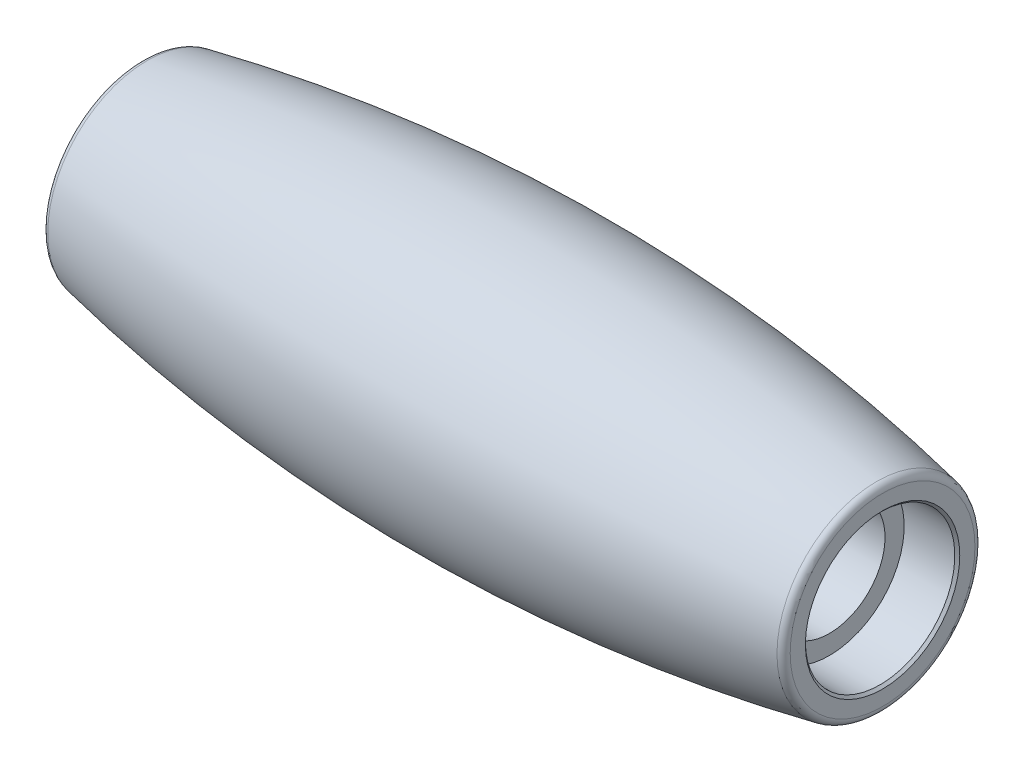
ISO-10303-21;
HEADER;
FILE_DESCRIPTION(('STEP AP214'),'2;1');
FILE_NAME('part.step','',(''),(''),'','','');
FILE_SCHEMA(('AUTOMOTIVE_DESIGN { 1 0 10303 214 1 1 1 1 }'));
ENDSEC;
DATA;
#1=APPLICATION_CONTEXT('core data for automotive mechanical design processes');
#2=APPLICATION_PROTOCOL_DEFINITION('international standard','automotive_design',2000,#1);
#3=PRODUCT_CONTEXT('',#1,'mechanical');
#4=PRODUCT('Part','Part','',(#3));
#5=PRODUCT_RELATED_PRODUCT_CATEGORY('part','',(#4));
#6=PRODUCT_DEFINITION_FORMATION('','',#4);
#7=PRODUCT_DEFINITION_CONTEXT('part definition',#1,'design');
#8=PRODUCT_DEFINITION('design','',#6,#7);
#9=PRODUCT_DEFINITION_SHAPE('','',#8);
#10=(LENGTH_UNIT() NAMED_UNIT(*) SI_UNIT(.MILLI.,.METRE.));
#11=(NAMED_UNIT(*) PLANE_ANGLE_UNIT() SI_UNIT($,.RADIAN.));
#12=(NAMED_UNIT(*) SI_UNIT($,.STERADIAN.) SOLID_ANGLE_UNIT());
#13=UNCERTAINTY_MEASURE_WITH_UNIT(LENGTH_MEASURE(1.E-05),#10,'distance_accuracy_value','');
#14=(GEOMETRIC_REPRESENTATION_CONTEXT(3) GLOBAL_UNCERTAINTY_ASSIGNED_CONTEXT((#13)) GLOBAL_UNIT_ASSIGNED_CONTEXT((#10,
#11,#12)) REPRESENTATION_CONTEXT('',''));
#15=CARTESIAN_POINT('',(0.,0.,0.));
#16=DIRECTION('',(0.,0.,1.));
#17=DIRECTION('',(1.,0.,0.));
#18=AXIS2_PLACEMENT_3D('',#15,#16,#17);
#19=CARTESIAN_POINT('',(-30.,9.375,0.));
#20=DIRECTION('',(-1.,0.,0.));
#21=DIRECTION('',(0.,0.,-1.));
#22=AXIS2_PLACEMENT_3D('',#19,#20,#21);
#23=PLANE('',#22);
#24=CARTESIAN_POINT('',(-30.,0.,0.));
#25=DIRECTION('',(1.,0.,0.));
#26=DIRECTION('',(0.,0.,-1.));
#27=AXIS2_PLACEMENT_3D('',#24,#25,#26);
#28=CIRCLE('',#27,6.24999999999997);
#29=CARTESIAN_POINT('',(-30.,0.,-6.24999999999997));
#30=VERTEX_POINT('',#29);
#31=EDGE_CURVE('E54',#30,#30,#28,.F.);
#32=ORIENTED_EDGE('',*,*,#31,.F.);
#33=EDGE_LOOP('',(#32));
#34=FACE_BOUND('',#33,.T.);
#35=CARTESIAN_POINT('',(-30.,0.,0.));
#36=DIRECTION('',(1.,0.,0.));
#37=DIRECTION('',(0.,0.,-1.));
#38=AXIS2_PLACEMENT_3D('',#35,#36,#37);
#39=CIRCLE('',#38,7.47866738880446);
#40=CARTESIAN_POINT('',(-30.,0.,-7.47866738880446));
#41=VERTEX_POINT('',#40);
#42=EDGE_CURVE('E86',#41,#41,#39,.T.);
#43=ORIENTED_EDGE('',*,*,#42,.F.);
#44=EDGE_LOOP('',(#43));
#45=FACE_BOUND('',#44,.T.);
#46=ADVANCED_FACE('F50',(#34,#45),#23,.T.);
#47=CARTESIAN_POINT('',(30.,9.375,0.));
#48=DIRECTION('',(-1.,0.,0.));
#49=DIRECTION('',(0.,0.,-1.));
#50=AXIS2_PLACEMENT_3D('',#47,#48,#49);
#51=PLANE('',#50);
#52=CARTESIAN_POINT('',(30.,0.,0.));
#53=DIRECTION('',(1.,0.,0.));
#54=DIRECTION('',(0.,0.,-1.));
#55=AXIS2_PLACEMENT_3D('',#52,#53,#54);
#56=CIRCLE('',#55,6.25000000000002);
#57=CARTESIAN_POINT('',(30.,0.,-6.25000000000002));
#58=VERTEX_POINT('',#57);
#59=EDGE_CURVE('E95',#58,#58,#56,.T.);
#60=ORIENTED_EDGE('',*,*,#59,.F.);
#61=EDGE_LOOP('',(#60));
#62=FACE_BOUND('',#61,.T.);
#63=CARTESIAN_POINT('',(30.,0.,0.));
#64=DIRECTION('',(1.,0.,0.));
#65=DIRECTION('',(0.,0.,-1.));
#66=AXIS2_PLACEMENT_3D('',#63,#64,#65);
#67=CIRCLE('',#66,7.47866738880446);
#68=CARTESIAN_POINT('',(30.,0.,-7.47866738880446));
#69=VERTEX_POINT('',#68);
#70=EDGE_CURVE('E81',#69,#69,#67,.F.);
#71=ORIENTED_EDGE('',*,*,#70,.F.);
#72=EDGE_LOOP('',(#71));
#73=FACE_BOUND('',#72,.T.);
#74=ADVANCED_FACE('F99',(#62,#73),#51,.F.);
#75=CARTESIAN_POINT('',(26.25,0.,0.));
#76=DIRECTION('',(-1.,0.,0.));
#77=DIRECTION('',(0.,0.,-1.));
#78=AXIS2_PLACEMENT_3D('',#75,#76,#77);
#79=CYLINDRICAL_SURFACE('',#78,4.5);
#80=CARTESIAN_POINT('',(-25.7,0.,0.));
#81=DIRECTION('',(1.,0.,0.));
#82=DIRECTION('',(0.,0.,-1.));
#83=AXIS2_PLACEMENT_3D('',#80,#81,#82);
#84=CIRCLE('',#83,4.5);
#85=CARTESIAN_POINT('',(-25.7,0.,4.5));
#86=VERTEX_POINT('',#85);
#87=EDGE_CURVE('E71',#86,#86,#84,.F.);
#88=ORIENTED_EDGE('',*,*,#87,.T.);
#89=DIRECTION('',(-1.,0.,0.));
#90=VECTOR('',#89,1.);
#91=CARTESIAN_POINT('',(26.25,0.,4.5));
#92=LINE('',#91,#90);
#93=CARTESIAN_POINT('',(25.7,0.,4.5));
#94=VERTEX_POINT('',#93);
#95=EDGE_CURVE('E65',#94,#86,#92,.T.);
#96=ORIENTED_EDGE('',*,*,#95,.F.);
#97=CARTESIAN_POINT('',(25.7,0.,0.));
#98=DIRECTION('',(-1.,0.,0.));
#99=DIRECTION('',(0.,0.,1.));
#100=AXIS2_PLACEMENT_3D('',#97,#98,#99);
#101=CIRCLE('',#100,4.5);
#102=EDGE_CURVE('E64',#94,#94,#101,.F.);
#103=ORIENTED_EDGE('',*,*,#102,.T.);
#104=ORIENTED_EDGE('',*,*,#95,.T.);
#105=EDGE_LOOP('',(#88,#96,#103,#104));
#106=FACE_BOUND('',#105,.T.);
#107=ADVANCED_FACE('F62',(#106),#79,.F.);
#108=CARTESIAN_POINT('',(25.7,0.,0.));
#109=DIRECTION('',(1.,0.,0.));
#110=DIRECTION('',(0.,0.,1.));
#111=AXIS2_PLACEMENT_3D('',#108,#109,#110);
#112=PLANE('',#111);
#113=CARTESIAN_POINT('',(25.7,0.,0.));
#114=DIRECTION('',(-1.,0.,0.));
#115=DIRECTION('',(0.,0.,1.));
#116=AXIS2_PLACEMENT_3D('',#113,#114,#115);
#117=CIRCLE('',#116,6.05);
#118=CARTESIAN_POINT('',(25.7,0.,6.05));
#119=VERTEX_POINT('',#118);
#120=EDGE_CURVE('E70',#119,#119,#117,.T.);
#121=ORIENTED_EDGE('',*,*,#120,.F.);
#122=EDGE_LOOP('',(#121));
#123=FACE_BOUND('',#122,.T.);
#124=ORIENTED_EDGE('',*,*,#102,.F.);
#125=EDGE_LOOP('',(#124));
#126=FACE_BOUND('',#125,.T.);
#127=ADVANCED_FACE('F124',(#123,#126),#112,.T.);
#128=CARTESIAN_POINT('',(25.7,0.,0.));
#129=DIRECTION('',(1.,0.,0.));
#130=DIRECTION('',(0.,0.,1.));
#131=AXIS2_PLACEMENT_3D('',#128,#129,#130);
#132=CYLINDRICAL_SURFACE('',#131,6.05);
#133=CARTESIAN_POINT('',(29.8,0.,0.));
#134=DIRECTION('',(1.,0.,0.));
#135=DIRECTION('',(0.,0.,-1.));
#136=AXIS2_PLACEMENT_3D('',#133,#134,#135);
#137=CIRCLE('',#136,6.05);
#138=CARTESIAN_POINT('',(29.8,0.,6.05));
#139=VERTEX_POINT('',#138);
#140=EDGE_CURVE('E87',#139,#139,#137,.F.);
#141=CARTESIAN_POINT('',(29.8,0.,6.05));
#142=CARTESIAN_POINT('',(29.7572916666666,0.,6.05));
#143=CARTESIAN_POINT('',(29.7145833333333,0.,6.05));
#144=CARTESIAN_POINT('',(29.6291666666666,0.,6.05));
#145=CARTESIAN_POINT('',(29.5864583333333,0.,6.05));
#146=CARTESIAN_POINT('',(29.5010416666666,0.,6.05));
#147=CARTESIAN_POINT('',(29.4583333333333,0.,6.05));
#148=CARTESIAN_POINT('',(29.3729166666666,0.,6.05));
#149=CARTESIAN_POINT('',(29.3302083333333,0.,6.05));
#150=CARTESIAN_POINT('',(29.2447916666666,0.,6.05));
#151=CARTESIAN_POINT('',(29.2020833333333,0.,6.05));
#152=CARTESIAN_POINT('',(29.1166666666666,0.,6.05));
#153=CARTESIAN_POINT('',(29.0739583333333,0.,6.05));
#154=CARTESIAN_POINT('',(28.9885416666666,0.,6.05));
#155=CARTESIAN_POINT('',(28.9458333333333,0.,6.05));
#156=CARTESIAN_POINT('',(28.8604166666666,0.,6.05));
#157=CARTESIAN_POINT('',(28.8177083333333,0.,6.05));
#158=CARTESIAN_POINT('',(28.7322916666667,0.,6.05));
#159=CARTESIAN_POINT('',(28.6895833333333,0.,6.05));
#160=CARTESIAN_POINT('',(28.6041666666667,0.,6.05));
#161=CARTESIAN_POINT('',(28.5614583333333,0.,6.05));
#162=CARTESIAN_POINT('',(28.4760416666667,0.,6.05));
#163=CARTESIAN_POINT('',(28.4333333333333,0.,6.05));
#164=CARTESIAN_POINT('',(28.3479166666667,0.,6.05));
#165=CARTESIAN_POINT('',(28.3052083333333,0.,6.05));
#166=CARTESIAN_POINT('',(28.2197916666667,0.,6.05));
#167=CARTESIAN_POINT('',(28.1770833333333,0.,6.05));
#168=CARTESIAN_POINT('',(28.0916666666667,0.,6.05));
#169=CARTESIAN_POINT('',(28.0489583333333,0.,6.05));
#170=CARTESIAN_POINT('',(27.9635416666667,0.,6.05));
#171=CARTESIAN_POINT('',(27.9208333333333,0.,6.05));
#172=CARTESIAN_POINT('',(27.8354166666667,0.,6.05));
#173=CARTESIAN_POINT('',(27.7927083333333,0.,6.05));
#174=CARTESIAN_POINT('',(27.7072916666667,0.,6.05));
#175=CARTESIAN_POINT('',(27.6645833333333,0.,6.05));
#176=CARTESIAN_POINT('',(27.5791666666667,0.,6.05));
#177=CARTESIAN_POINT('',(27.5364583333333,0.,6.05));
#178=CARTESIAN_POINT('',(27.4510416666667,0.,6.05));
#179=CARTESIAN_POINT('',(27.4083333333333,0.,6.05));
#180=CARTESIAN_POINT('',(27.3229166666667,0.,6.05));
#181=CARTESIAN_POINT('',(27.2802083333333,0.,6.05));
#182=CARTESIAN_POINT('',(27.1947916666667,0.,6.05));
#183=CARTESIAN_POINT('',(27.1520833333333,0.,6.05));
#184=CARTESIAN_POINT('',(27.0666666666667,0.,6.05));
#185=CARTESIAN_POINT('',(27.0239583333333,0.,6.05));
#186=CARTESIAN_POINT('',(26.9385416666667,0.,6.05));
#187=CARTESIAN_POINT('',(26.8958333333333,0.,6.05));
#188=CARTESIAN_POINT('',(26.8104166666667,0.,6.05));
#189=CARTESIAN_POINT('',(26.7677083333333,0.,6.05));
#190=CARTESIAN_POINT('',(26.6822916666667,0.,6.05));
#191=CARTESIAN_POINT('',(26.6395833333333,0.,6.05));
#192=CARTESIAN_POINT('',(26.5541666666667,0.,6.05));
#193=CARTESIAN_POINT('',(26.5114583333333,0.,6.05));
#194=CARTESIAN_POINT('',(26.4260416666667,0.,6.05));
#195=CARTESIAN_POINT('',(26.3833333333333,0.,6.05));
#196=CARTESIAN_POINT('',(26.2979166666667,0.,6.05));
#197=CARTESIAN_POINT('',(26.2552083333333,0.,6.05));
#198=CARTESIAN_POINT('',(26.1697916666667,0.,6.05));
#199=CARTESIAN_POINT('',(26.1270833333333,0.,6.05));
#200=CARTESIAN_POINT('',(26.0416666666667,0.,6.05));
#201=CARTESIAN_POINT('',(25.9989583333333,0.,6.05));
#202=CARTESIAN_POINT('',(25.9135416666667,0.,6.05));
#203=CARTESIAN_POINT('',(25.8708333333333,0.,6.05));
#204=CARTESIAN_POINT('',(25.7854166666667,0.,6.05));
#205=CARTESIAN_POINT('',(25.7427083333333,0.,6.05));
#206=CARTESIAN_POINT('',(25.7,0.,6.05));
#207=B_SPLINE_CURVE_WITH_KNOTS('',3,(#141,#142,#143,#144,#145,#146,#147,#148,#149,#150,#151,
#152,#153,#154,#155,#156,#157,#158,#159,#160,#161,#162,#163,#164,#165,#166,#167,#168,#169,#170,
#171,#172,#173,#174,#175,#176,#177,#178,#179,#180,#181,#182,#183,#184,#185,#186,#187,#188,#189,
#190,#191,#192,#193,#194,#195,#196,#197,#198,#199,#200,#201,#202,#203,#204,#205,#206),
.UNSPECIFIED.,.F.,.F.,(4,2,2,2,2,2,2,2,2,2,2,2,2,2,2,2,2,2,2,2,2,2,2,2,2,2,2,2,2,2,2,2,4),(0.,
0.128124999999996,0.256249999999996,0.384374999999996,0.512499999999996,0.640624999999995,
0.768749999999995,0.896874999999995,1.02499999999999,1.15312499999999,1.28124999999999,
1.40937499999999,1.53749999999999,1.66562499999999,1.79374999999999,1.92187499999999,
2.04999999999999,2.17812499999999,2.30624999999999,2.43437499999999,2.56249999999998,
2.69062499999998,2.81874999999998,2.94687499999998,3.07499999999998,3.20312499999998,
3.33124999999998,3.45937499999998,3.58749999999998,3.71562499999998,3.84374999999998,
3.97187499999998,4.09999999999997),.UNSPECIFIED.);
#208=EDGE_CURVE('BSEAM128',#139,#119,#207,.T.);
#209=ORIENTED_EDGE('',*,*,#140,.F.);
#210=ORIENTED_EDGE('',*,*,#120,.T.);
#211=ORIENTED_EDGE('',*,*,#208,.T.);
#212=ORIENTED_EDGE('',*,*,#208,.F.);
#213=EDGE_LOOP('',(#209,#211,#210,#212));
#214=FACE_BOUND('',#213,.T.);
#215=ADVANCED_FACE('F128',(#214),#132,.F.);
#216=CARTESIAN_POINT('',(-25.7,0.,0.));
#217=DIRECTION('',(-1.,0.,0.));
#218=DIRECTION('',(0.,0.,1.));
#219=AXIS2_PLACEMENT_3D('',#216,#217,#218);
#220=PLANE('',#219);
#221=CARTESIAN_POINT('',(-25.7,0.,0.));
#222=DIRECTION('',(-1.,0.,0.));
#223=DIRECTION('',(0.,0.,1.));
#224=AXIS2_PLACEMENT_3D('',#221,#222,#223);
#225=CIRCLE('',#224,6.05);
#226=CARTESIAN_POINT('',(-25.7,0.,-6.05));
#227=VERTEX_POINT('',#226);
#228=EDGE_CURVE('E77',#227,#227,#225,.T.);
#229=ORIENTED_EDGE('',*,*,#228,.T.);
#230=EDGE_LOOP('',(#229));
#231=FACE_BOUND('',#230,.T.);
#232=ORIENTED_EDGE('',*,*,#87,.F.);
#233=EDGE_LOOP('',(#232));
#234=FACE_BOUND('',#233,.T.);
#235=ADVANCED_FACE('F129',(#231,#234),#220,.T.);
#236=CARTESIAN_POINT('',(-25.7,0.,0.));
#237=DIRECTION('',(-1.,0.,0.));
#238=DIRECTION('',(0.,0.,-1.));
#239=AXIS2_PLACEMENT_3D('',#236,#237,#238);
#240=CYLINDRICAL_SURFACE('',#239,6.05);
#241=CARTESIAN_POINT('',(-29.8,0.,0.));
#242=DIRECTION('',(1.,0.,0.));
#243=DIRECTION('',(0.,0.,-1.));
#244=AXIS2_PLACEMENT_3D('',#241,#242,#243);
#245=CIRCLE('',#244,6.05);
#246=CARTESIAN_POINT('',(-29.8,0.,-6.05));
#247=VERTEX_POINT('',#246);
#248=EDGE_CURVE('E11',#247,#247,#245,.T.);
#249=CARTESIAN_POINT('',(-29.8,0.,-6.05));
#250=CARTESIAN_POINT('',(-29.7572916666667,0.,-6.05));
#251=CARTESIAN_POINT('',(-29.7145833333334,0.,-6.05));
#252=CARTESIAN_POINT('',(-29.6291666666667,0.,-6.05));
#253=CARTESIAN_POINT('',(-29.5864583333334,0.,-6.05));
#254=CARTESIAN_POINT('',(-29.5010416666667,0.,-6.05));
#255=CARTESIAN_POINT('',(-29.4583333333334,0.,-6.05));
#256=CARTESIAN_POINT('',(-29.3729166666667,0.,-6.05));
#257=CARTESIAN_POINT('',(-29.3302083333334,0.,-6.05));
#258=CARTESIAN_POINT('',(-29.2447916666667,0.,-6.05));
#259=CARTESIAN_POINT('',(-29.2020833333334,0.,-6.05));
#260=CARTESIAN_POINT('',(-29.1166666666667,0.,-6.05));
#261=CARTESIAN_POINT('',(-29.0739583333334,0.,-6.05));
#262=CARTESIAN_POINT('',(-28.9885416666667,0.,-6.05));
#263=CARTESIAN_POINT('',(-28.9458333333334,0.,-6.05));
#264=CARTESIAN_POINT('',(-28.8604166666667,0.,-6.05));
#265=CARTESIAN_POINT('',(-28.8177083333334,0.,-6.05));
#266=CARTESIAN_POINT('',(-28.7322916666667,0.,-6.05));
#267=CARTESIAN_POINT('',(-28.6895833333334,0.,-6.05));
#268=CARTESIAN_POINT('',(-28.6041666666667,0.,-6.05));
#269=CARTESIAN_POINT('',(-28.5614583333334,0.,-6.05));
#270=CARTESIAN_POINT('',(-28.4760416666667,0.,-6.05));
#271=CARTESIAN_POINT('',(-28.4333333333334,0.,-6.05));
#272=CARTESIAN_POINT('',(-28.3479166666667,0.,-6.05));
#273=CARTESIAN_POINT('',(-28.3052083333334,0.,-6.05));
#274=CARTESIAN_POINT('',(-28.2197916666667,0.,-6.05));
#275=CARTESIAN_POINT('',(-28.1770833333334,0.,-6.05));
#276=CARTESIAN_POINT('',(-28.0916666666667,0.,-6.05));
#277=CARTESIAN_POINT('',(-28.0489583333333,0.,-6.05));
#278=CARTESIAN_POINT('',(-27.9635416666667,0.,-6.05));
#279=CARTESIAN_POINT('',(-27.9208333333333,0.,-6.05));
#280=CARTESIAN_POINT('',(-27.8354166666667,0.,-6.05));
#281=CARTESIAN_POINT('',(-27.7927083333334,0.,-6.05));
#282=CARTESIAN_POINT('',(-27.7072916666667,0.,-6.05));
#283=CARTESIAN_POINT('',(-27.6645833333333,0.,-6.05));
#284=CARTESIAN_POINT('',(-27.5791666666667,0.,-6.05));
#285=CARTESIAN_POINT('',(-27.5364583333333,0.,-6.05));
#286=CARTESIAN_POINT('',(-27.4510416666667,0.,-6.05));
#287=CARTESIAN_POINT('',(-27.4083333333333,0.,-6.05));
#288=CARTESIAN_POINT('',(-27.3229166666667,0.,-6.05));
#289=CARTESIAN_POINT('',(-27.2802083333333,0.,-6.05));
#290=CARTESIAN_POINT('',(-27.1947916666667,0.,-6.05));
#291=CARTESIAN_POINT('',(-27.1520833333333,0.,-6.05));
#292=CARTESIAN_POINT('',(-27.0666666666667,0.,-6.05));
#293=CARTESIAN_POINT('',(-27.0239583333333,0.,-6.05));
#294=CARTESIAN_POINT('',(-26.9385416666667,0.,-6.05));
#295=CARTESIAN_POINT('',(-26.8958333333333,0.,-6.05));
#296=CARTESIAN_POINT('',(-26.8104166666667,0.,-6.05));
#297=CARTESIAN_POINT('',(-26.7677083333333,0.,-6.05));
#298=CARTESIAN_POINT('',(-26.6822916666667,0.,-6.05));
#299=CARTESIAN_POINT('',(-26.6395833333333,0.,-6.05));
#300=CARTESIAN_POINT('',(-26.5541666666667,0.,-6.05));
#301=CARTESIAN_POINT('',(-26.5114583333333,0.,-6.05));
#302=CARTESIAN_POINT('',(-26.4260416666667,0.,-6.05));
#303=CARTESIAN_POINT('',(-26.3833333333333,0.,-6.05));
#304=CARTESIAN_POINT('',(-26.2979166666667,0.,-6.05));
#305=CARTESIAN_POINT('',(-26.2552083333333,0.,-6.05));
#306=CARTESIAN_POINT('',(-26.1697916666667,0.,-6.05));
#307=CARTESIAN_POINT('',(-26.1270833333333,0.,-6.05));
#308=CARTESIAN_POINT('',(-26.0416666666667,0.,-6.05));
#309=CARTESIAN_POINT('',(-25.9989583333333,0.,-6.05));
#310=CARTESIAN_POINT('',(-25.9135416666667,0.,-6.05));
#311=CARTESIAN_POINT('',(-25.8708333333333,0.,-6.05));
#312=CARTESIAN_POINT('',(-25.7854166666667,0.,-6.05));
#313=CARTESIAN_POINT('',(-25.7427083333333,0.,-6.05));
#314=CARTESIAN_POINT('',(-25.7,0.,-6.05));
#315=B_SPLINE_CURVE_WITH_KNOTS('',3,(#249,#250,#251,#252,#253,#254,#255,#256,#257,#258,#259,
#260,#261,#262,#263,#264,#265,#266,#267,#268,#269,#270,#271,#272,#273,#274,#275,#276,#277,#278,
#279,#280,#281,#282,#283,#284,#285,#286,#287,#288,#289,#290,#291,#292,#293,#294,#295,#296,#297,
#298,#299,#300,#301,#302,#303,#304,#305,#306,#307,#308,#309,#310,#311,#312,#313,#314),
.UNSPECIFIED.,.F.,.F.,(4,2,2,2,2,2,2,2,2,2,2,2,2,2,2,2,2,2,2,2,2,2,2,2,2,2,2,2,2,2,2,2,4),(0.,
0.128125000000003,0.256250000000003,0.384375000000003,0.512500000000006,0.640625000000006,
0.768750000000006,0.896875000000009,1.02500000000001,1.15312500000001,1.28125000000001,
1.40937500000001,1.53750000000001,1.66562500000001,1.79375000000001,1.92187500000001,
2.05000000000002,2.17812500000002,2.30625000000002,2.43437500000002,2.56250000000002,
2.69062500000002,2.81875000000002,2.94687500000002,3.07500000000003,3.20312500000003,
3.33125000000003,3.45937500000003,3.58750000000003,3.71562500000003,3.84375000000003,
3.97187500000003,4.10000000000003),.UNSPECIFIED.);
#316=EDGE_CURVE('BSEAM132',#247,#227,#315,.T.);
#317=ORIENTED_EDGE('',*,*,#248,.F.);
#318=ORIENTED_EDGE('',*,*,#228,.F.);
#319=ORIENTED_EDGE('',*,*,#316,.T.);
#320=ORIENTED_EDGE('',*,*,#316,.F.);
#321=EDGE_LOOP('',(#317,#319,#318,#320));
#322=FACE_BOUND('',#321,.T.);
#323=ADVANCED_FACE('F132',(#322),#240,.F.);
#324=CARTESIAN_POINT('',(0.,0.,0.));
#325=DIRECTION('',(-1.,0.,0.));
#326=DIRECTION('',(0.,-1.,0.));
#327=AXIS2_PLACEMENT_3D('',#324,#325,#326);
#328=DEGENERATE_TOROIDAL_SURFACE('',#327,139.,150.,.F.);
#329=CARTESIAN_POINT('',(29.5180722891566,0.,0.));
#330=DIRECTION('',(1.,0.,0.));
#331=DIRECTION('',(0.,0.,-1.));
#332=AXIS2_PLACEMENT_3D('',#329,#330,#331);
#333=CIRCLE('',#332,8.06693512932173);
#334=CARTESIAN_POINT('',(29.5180722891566,0.,-8.06693512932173));
#335=VERTEX_POINT('',#334);
#336=EDGE_CURVE('E79',#335,#335,#333,.T.);
#337=ORIENTED_EDGE('',*,*,#336,.F.);
#338=EDGE_LOOP('',(#337));
#339=FACE_BOUND('',#338,.T.);
#340=CARTESIAN_POINT('',(-29.5180722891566,0.,0.));
#341=DIRECTION('',(-1.,0.,0.));
#342=DIRECTION('',(0.,0.,1.));
#343=AXIS2_PLACEMENT_3D('',#340,#341,#342);
#344=CIRCLE('',#343,8.06693512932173);
#345=CARTESIAN_POINT('',(-29.5180722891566,0.,8.06693512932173));
#346=VERTEX_POINT('',#345);
#347=EDGE_CURVE('E68',#346,#346,#344,.T.);
#348=ORIENTED_EDGE('',*,*,#347,.F.);
#349=EDGE_LOOP('',(#348));
#350=FACE_BOUND('',#349,.T.);
#351=ADVANCED_FACE('F118',(#339,#350),#328,.F.);
#352=CARTESIAN_POINT('',(29.4,0.,0.));
#353=DIRECTION('',(-1.,0.,0.));
#354=DIRECTION('',(0.,0.,-1.));
#355=AXIS2_PLACEMENT_3D('',#352,#353,#354);
#356=TOROIDAL_SURFACE('',#355,7.47866738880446,0.6);
#357=ORIENTED_EDGE('',*,*,#70,.T.);
#358=EDGE_LOOP('',(#357));
#359=FACE_BOUND('',#358,.T.);
#360=ORIENTED_EDGE('',*,*,#336,.T.);
#361=EDGE_LOOP('',(#360));
#362=FACE_BOUND('',#361,.T.);
#363=ADVANCED_FACE('F110',(#359,#362),#356,.T.);
#364=CARTESIAN_POINT('',(-29.4,0.,0.));
#365=DIRECTION('',(-1.,0.,0.));
#366=DIRECTION('',(0.,0.,-1.));
#367=AXIS2_PLACEMENT_3D('',#364,#365,#366);
#368=TOROIDAL_SURFACE('',#367,7.47866738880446,0.6);
#369=ORIENTED_EDGE('',*,*,#347,.T.);
#370=EDGE_LOOP('',(#369));
#371=FACE_BOUND('',#370,.T.);
#372=ORIENTED_EDGE('',*,*,#42,.T.);
#373=EDGE_LOOP('',(#372));
#374=FACE_BOUND('',#373,.T.);
#375=ADVANCED_FACE('F101',(#371,#374),#368,.T.);
#376=CARTESIAN_POINT('',(29.8,0.,0.));
#377=DIRECTION('',(1.,0.,0.));
#378=DIRECTION('',(0.,0.,1.));
#379=AXIS2_PLACEMENT_3D('',#376,#377,#378);
#380=CONICAL_SURFACE('',#379,6.05,0.785398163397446);
#381=ORIENTED_EDGE('',*,*,#59,.T.);
#382=EDGE_LOOP('',(#381));
#383=FACE_BOUND('',#382,.T.);
#384=ORIENTED_EDGE('',*,*,#140,.T.);
#385=EDGE_LOOP('',(#384));
#386=FACE_BOUND('',#385,.T.);
#387=ADVANCED_FACE('F108',(#383,#386),#380,.F.);
#388=CARTESIAN_POINT('',(-30.,0.,0.));
#389=DIRECTION('',(-1.,0.,0.));
#390=DIRECTION('',(0.,0.,-1.));
#391=AXIS2_PLACEMENT_3D('',#388,#389,#390);
#392=CONICAL_SURFACE('',#391,6.24999999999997,0.785398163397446);
#393=ORIENTED_EDGE('',*,*,#248,.T.);
#394=EDGE_LOOP('',(#393));
#395=FACE_BOUND('',#394,.T.);
#396=ORIENTED_EDGE('',*,*,#31,.T.);
#397=EDGE_LOOP('',(#396));
#398=FACE_BOUND('',#397,.T.);
#399=ADVANCED_FACE('F47',(#395,#398),#392,.F.);
#400=CLOSED_SHELL('',(#46,#74,#107,#127,#215,#235,#323,#351,#363,#375,#387,#399));
#401=MANIFOLD_SOLID_BREP('B2',#400);
#402=ADVANCED_BREP_SHAPE_REPRESENTATION('',(#18,#401),#14);
#403=SHAPE_DEFINITION_REPRESENTATION(#9,#402);
ENDSEC;
END-ISO-10303-21;
